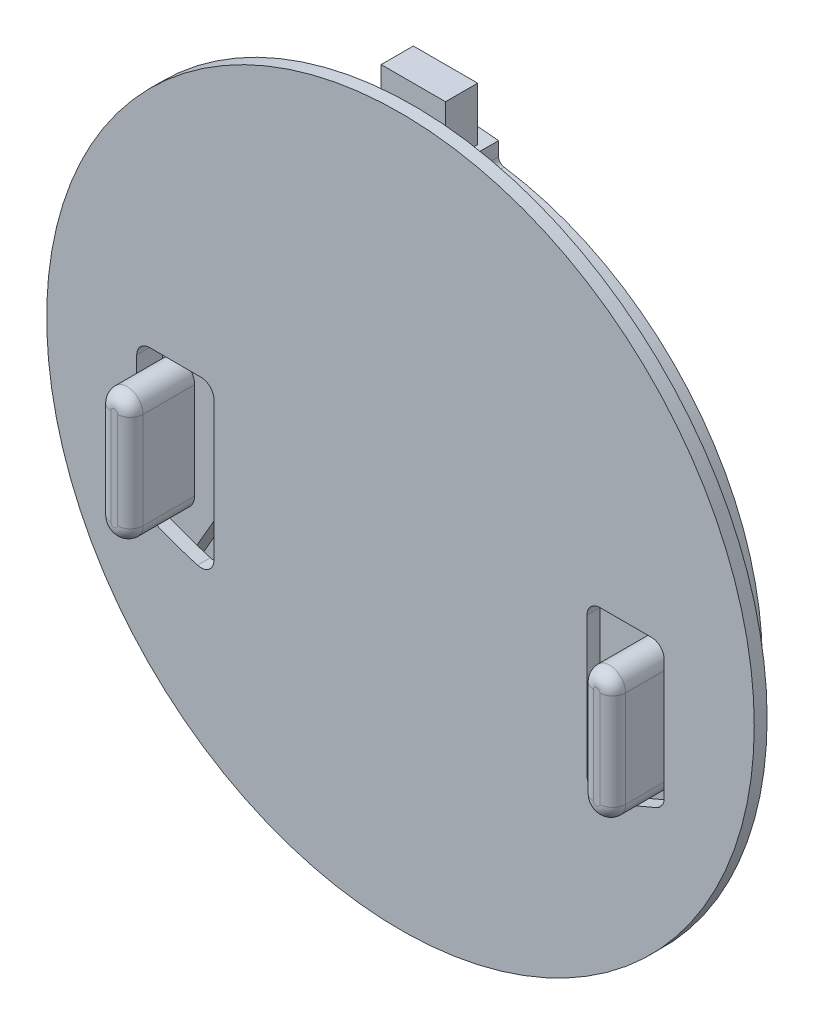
from build123d import *

# Parameters (mm, degrees)
ESQUISSE1_R              = 55
BOSS_EXTRU_1_DEPTH       = 2
ESQUISSE2_W              = 10
ESQUISSE2_H              = 5
BOSS_EXTRU_2_DEPTH       = 58
ESQUISSE3_R              = 5
BOSS_EXTRU_3_DEPTH       = 1
ESQUISSE5_R              = 5
BOSS_EXTRU_4_DEPTH       = 0.75
BOSS_EXTRU_5_DEPTH       = 3
BOSS_EXTRU_6_START       = -4.25
BOSS_EXTRU_6_DEPTH       = 4.25
BOSS_EXTRU_8_DEPTH       = 10
CONG_1_R                 = 2
CONG_1_OF_SYM_TRIE3_R    = 2
ENL_V_START              = -2
ENL_V_MAT_EXTRU_14_DEPTH = 2
BOSS_EXTRU_7_DEPTH       = 3


with BuildPart() as part:
    # Esquisse1 → Boss.-Extru.1 (new body)
    with BuildSketch(Plane.XY):
        Circle(ESQUISSE1_R)
    extrude(amount=BOSS_EXTRU_1_DEPTH)

    # Esquisse3 → Boss.-Extru.3 (add)
    with BuildSketch(Plane(origin=(0, 0, 0), x_dir=(-1, 0, 0), z_dir=(0, 0, -1))):
        with Locations(Location((15, 36, 0), (0, 0, 180))):
            Circle(ESQUISSE3_R)
        with Locations(Location((-15, 36, 0), (0, 0, 180))):
            Circle(ESQUISSE3_R)
    extrude(amount=BOSS_EXTRU_3_DEPTH)

    # Esquisse5 → Boss.-Extru.4 (add)
    with BuildSketch(Plane(origin=(0, 0, 0), x_dir=(-1, 0, 0), z_dir=(0, 0, -1))):
        with Locations(Location((25, 8, 0), (0, 0, 180))):
            Circle(ESQUISSE5_R)
        with Locations(Location((-25, 8, 0), (0, 0, 180))):
            Circle(ESQUISSE5_R)
    extrude(amount=BOSS_EXTRU_4_DEPTH)

    # Esquisse4 → Boss.-Extru.5 (add)
    with BuildSketch(Plane(origin=(0, 0, -1), x_dir=(-1, 0, 0), z_dir=(0, 0, -1))):
        with BuildLine():
            Line((15, 44), (13, 44))
            ThreePointArc((13, 44), (9.464466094, 42.535533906), (8, 39))
            Line((8, 39), (8, 25.464101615))
            ThreePointArc((8, 25.464101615), (8.170370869, 24.17000639), (8.669872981, 22.964101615))
            Line((8.669872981, 22.964101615), (36.669872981, -25.533320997))
            ThreePointArc((36.669872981, -25.533320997), (37.146628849, -26.15464134), (37.767949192, -26.631397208))
            Line((37.767949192, -26.631397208), (41.059980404, -28.532052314))
            ThreePointArc((41.059980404, -28.532052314), (43.210954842, -25.155782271), (45.084931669, -21.618254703))
            Line((45.084931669, -21.618254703), (41.5, -19.548493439))
            ThreePointArc((41.5, -19.548493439), (40.401923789, -18.450417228), (40, -16.950417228))
            Line((40, -16.950417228), (40, 6.019237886))
            ThreePointArc((40, 6.019237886), (39.659258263, 8.607428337), (38.660254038, 11.019237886))
            Line((38.660254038, 11.019237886), (21.92820323, 40))
            ThreePointArc((21.92820323, 40), (19, 42.92820323), (15, 44))
        make_face()
        with BuildLine():
            Line((-21.92820323, 40), (-38.660254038, 11.019237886))
            ThreePointArc((-38.660254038, 11.019237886), (-39.659258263, 8.607428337), (-40, 6.019237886))
            Line((-40, 6.019237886), (-40, -16.950417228))
            ThreePointArc((-40, -16.950417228), (-40.401923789, -18.450417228), (-41.5, -19.548493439))
            Line((-41.5, -19.548493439), (-45.084931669, -21.618254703))
            ThreePointArc((-45.084931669, -21.618254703), (-43.210954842, -25.155782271), (-41.059980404, -28.532052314))
            Line((-41.059980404, -28.532052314), (-37.767949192, -26.631397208))
            ThreePointArc((-37.767949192, -26.631397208), (-37.146628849, -26.15464134), (-36.669872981, -25.533320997))
            Line((-36.669872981, -25.533320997), (-8.669872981, 22.964101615))
            ThreePointArc((-8.669872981, 22.964101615), (-8.170370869, 24.17000639), (-8, 25.464101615))
            Line((-8, 25.464101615), (-8, 39))
            ThreePointArc((-8, 39), (-9.464466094, 42.535533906), (-13, 44))
            Line((-13, 44), (-15, 44))
            ThreePointArc((-15, 44), (-19, 42.92820323), (-21.92820323, 40))
        make_face()
    extrude(amount=BOSS_EXTRU_5_DEPTH)

    # Esquisse7 → Boss.-Extru.6 (add)
    with BuildSketch(Plane(origin=(0, 0, -4.25), x_dir=(-1, 0, 0), z_dir=(0, 0, -1)).offset(BOSS_EXTRU_6_START)):
        with BuildLine():
            Line((26.146136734, 34.694324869), (39.660254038, 11.287187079))
            ThreePointArc((39.660254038, 11.287187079), (40.659258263, 8.87537753), (41, 6.287187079))
            Line((41, 6.287187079), (41, -14.363726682))
            ThreePointArc((41, -14.363726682), (41.579129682, 12.589385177), (26.146136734, 34.694324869))
        make_face()
        with BuildLine():
            Line((3, 42), (3, 23.320508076))
            ThreePointArc((3, 23.320508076), (3.068148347, 22.802869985), (3.267949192, 22.320508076))
            Line((3.267949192, 22.320508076), (31.951438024, -27.360751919))
            ThreePointArc((31.951438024, -27.360751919), (32.20616738, -28.590326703), (31.677737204, -29.729406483))
            ThreePointArc((31.677737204, -29.729406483), (0, -43.443257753), (-31.677737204, -29.729406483))
            ThreePointArc((-31.677737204, -29.729406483), (-32.20616738, -28.590326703), (-31.951438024, -27.360751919))
            Line((-31.951438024, -27.360751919), (-3.267949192, 22.320508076))
            ThreePointArc((-3.267949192, 22.320508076), (-3.068148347, 22.802869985), (-3, 23.320508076))
            Line((-3, 23.320508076), (-3, 42))
            Line((-3, 42), (-4, 42))
            ThreePointArc((-4, 42), (-5.414213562, 42.585786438), (-6, 44))
            Line((-6, 44), (-6, 49.638694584))
            ThreePointArc((-6, 49.638694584), (0, 50), (6, 49.638694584))
            Line((6, 49.638694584), (6, 44))
            ThreePointArc((6, 44), (5.414213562, 42.585786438), (4, 42))
            Line((4, 42), (3, 42))
        make_face()
        with BuildLine():
            Line((-41, 6.287187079), (-41, -14.363726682))
            ThreePointArc((-41, -14.363726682), (-41.579129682, 12.589385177), (-26.146136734, 34.694324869))
            Line((-26.146136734, 34.694324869), (-39.660254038, 11.287187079))
            ThreePointArc((-39.660254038, 11.287187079), (-40.659258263, 8.87537753), (-41, 6.287187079))
        make_face()
    extrude(amount=BOSS_EXTRU_6_DEPTH)

    # Esquisse9 → Boss.-Extru.8 (add)
    with BuildSketch(Plane.XY.offset(-1)):
        with BuildLine():
            Line((-35, -0.595140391), (-35, -15.595140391))
            ThreePointArc((-35, -15.595140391), (-37.5, -18.095140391), (-40, -15.595140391))
            Line((-40, -15.595140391), (-40, -0.595140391))
            ThreePointArc((-40, -0.595140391), (-37.5, 1.904859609), (-35, -0.595140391))
        make_face()
    boss_extru_8 = extrude(amount=BOSS_EXTRU_8_DEPTH)

    # Cong_1
    cong_1_edges = [part.edges().sort_by_distance(p)[0] for p in [
        (-37.5, 1.904859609, 9),
        (-40, -8.095140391, 9),
        (-37.5, -18.095140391, 9),
        (-35, -8.095140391, 9),
    ]]
    fillet(cong_1_edges, radius=CONG_1_R)

    # Sym_trie3: Boss.-Extru.8 across plane
    add(boss_extru_8.mirror(Plane(origin=(0, 0, 0), x_dir=(0, 0, 1), z_dir=(1, 0, 0))))

    # Cong_1 of Sym_trie3
    cong_1_of_sym_trie3_edges = [part.edges().sort_by_distance(p)[0] for p in [
        (37.5, 1.904859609, 9),
        (40, -8.095140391, 9),
        (37.5, -18.095140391, 9),
        (35, -8.095140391, 9),
    ]]
    fillet(cong_1_of_sym_trie3_edges, radius=CONG_1_OF_SYM_TRIE3_R)

    # Esquisse11 → Enl_v. mat.-Extru.14 (cut)
    with BuildSketch(Plane.XY.offset(2).offset(ENL_V_START)):
        with BuildLine():
            Line((-29, 1.904859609), (-29, -19.749439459))
            ThreePointArc((-29, -19.749439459), (-29.796556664, -21.346851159), (-31.551724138, -21.671833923))
            ThreePointArc((-31.551724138, -21.671833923), (-35.745766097, -20.299317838), (-39.827586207, -18.622257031))
            ThreePointArc((-39.827586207, -18.622257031), (-40.681542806, -17.884295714), (-41, -16.80151513))
            Line((-41, -16.80151513), (-41, 1.904859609))
            ThreePointArc((-41, 1.904859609), (-40.414213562, 3.319073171), (-39, 3.904859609))
            Line((-39, 3.904859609), (-31, 3.904859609))
            ThreePointArc((-31, 3.904859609), (-29.585786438, 3.319073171), (-29, 1.904859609))
        make_face()
        with BuildLine():
            Line((-40, -15.595140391), (-40, -0.595140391))
            ThreePointArc((-40, -0.595140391), (-37.5, 1.904859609), (-35, -0.595140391))
            Line((-35, -0.595140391), (-35, -15.595140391))
            ThreePointArc((-35, -15.595140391), (-37.5, -18.095140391), (-40, -15.595140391))
        make_face(mode=Mode.SUBTRACT)
    enl_v_mat_extru_14 = extrude(amount=ENL_V_MAT_EXTRU_14_DEPTH, mode=Mode.SUBTRACT)

    # Sym_trie4: Enl_v. mat.-Extru.14 across plane
    add(enl_v_mat_extru_14.mirror(Plane(origin=(0, 0, 0), x_dir=(0, 0, 1), z_dir=(1, 0, 0))), mode=Mode.SUBTRACT)

    # Esquisse8 → Boss.-Extru.7 (add)
    with BuildSketch(Plane(origin=(0, 0, -4.25), x_dir=(-1, 0, 0), z_dir=(0, 0, -1))):
        with BuildLine():
            ThreePointArc((37.245251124, -27.357641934), (37.845832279, -26.97094552), (38.551197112, -27.083605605))
            Line((38.551197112, -27.083605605), (41.059980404, -28.532052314))
            ThreePointArc((41.059980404, -28.532052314), (43.210954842, -25.155782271), (45.084931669, -21.618254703))
            Line((45.084931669, -21.618254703), (43.269316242, -20.570008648))
            ThreePointArc((43.269316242, -20.570008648), (42.817624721, -20.011039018), (42.857455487, -19.293483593))
            ThreePointArc((42.857455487, -19.293483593), (41.230155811, 22.562673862), (6.854166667, 46.49753111))
            ThreePointArc((6.854166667, 46.49753111), (6.243087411, 46.833324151), (6, 47.486840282))
            Line((6, 47.486840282), (6, 49.638694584))
            ThreePointArc((6, 49.638694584), (0, 50), (-6, 49.638694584))
            Line((-6, 49.638694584), (-6, 47.486840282))
            ThreePointArc((-6, 47.486840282), (-6.243087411, 46.833324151), (-6.854166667, 46.49753111))
            ThreePointArc((-6.854166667, 46.49753111), (-41.230155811, 22.562673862), (-42.857455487, -19.293483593))
            ThreePointArc((-42.857455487, -19.293483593), (-42.817624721, -20.011039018), (-43.269316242, -20.570008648))
            Line((-43.269316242, -20.570008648), (-45.084931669, -21.618254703))
            ThreePointArc((-45.084931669, -21.618254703), (-43.210954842, -25.155782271), (-41.059980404, -28.532052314))
            Line((-41.059980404, -28.532052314), (-38.551197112, -27.083605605))
            ThreePointArc((-38.551197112, -27.083605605), (-37.845832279, -26.97094552), (-37.245251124, -27.357641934))
            ThreePointArc((-37.245251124, -27.357641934), (0, -46.213085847), (37.245251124, -27.357641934))
        make_face()
    extrude(amount=BOSS_EXTRU_7_DEPTH)


with BuildPart() as body_2:
    # Esquisse2 → Boss.-Extru.2 (new body)
    with BuildSketch(Plane(origin=(0, 0, 0), x_dir=(1, 0, 0), z_dir=(0, 1, 0))):
        with Locations((0, 2.5)):
            Rectangle(ESQUISSE2_W, ESQUISSE2_H)
    extrude(amount=BOSS_EXTRU_2_DEPTH)


solid = Compound([part.part, body_2.part])
